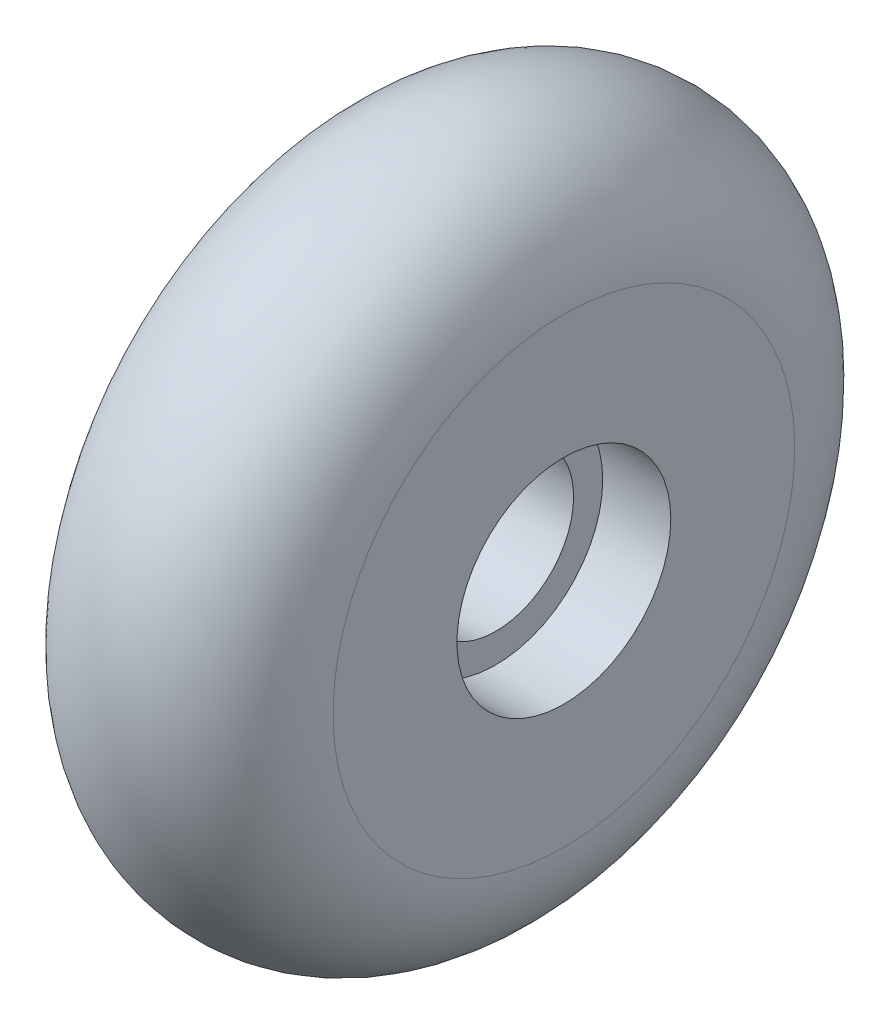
ISO-10303-21;
HEADER;
FILE_DESCRIPTION(('STEP AP214'),'2;1');
FILE_NAME('part.step','',(''),(''),'','','');
FILE_SCHEMA(('AUTOMOTIVE_DESIGN { 1 0 10303 214 1 1 1 1 }'));
ENDSEC;
DATA;
#1=APPLICATION_CONTEXT('core data for automotive mechanical design processes');
#2=APPLICATION_PROTOCOL_DEFINITION('international standard','automotive_design',2000,#1);
#3=PRODUCT_CONTEXT('',#1,'mechanical');
#4=PRODUCT('Part','Part','',(#3));
#5=PRODUCT_RELATED_PRODUCT_CATEGORY('part','',(#4));
#6=PRODUCT_DEFINITION_FORMATION('','',#4);
#7=PRODUCT_DEFINITION_CONTEXT('part definition',#1,'design');
#8=PRODUCT_DEFINITION('design','',#6,#7);
#9=PRODUCT_DEFINITION_SHAPE('','',#8);
#10=(LENGTH_UNIT() NAMED_UNIT(*) SI_UNIT(.MILLI.,.METRE.));
#11=(NAMED_UNIT(*) PLANE_ANGLE_UNIT() SI_UNIT($,.RADIAN.));
#12=(NAMED_UNIT(*) SI_UNIT($,.STERADIAN.) SOLID_ANGLE_UNIT());
#13=UNCERTAINTY_MEASURE_WITH_UNIT(LENGTH_MEASURE(1.E-05),#10,'distance_accuracy_value','');
#14=(GEOMETRIC_REPRESENTATION_CONTEXT(3) GLOBAL_UNCERTAINTY_ASSIGNED_CONTEXT((#13)) GLOBAL_UNIT_ASSIGNED_CONTEXT((#10,
#11,#12)) REPRESENTATION_CONTEXT('',''));
#15=CARTESIAN_POINT('',(0.,0.,0.));
#16=DIRECTION('',(0.,0.,1.));
#17=DIRECTION('',(1.,0.,0.));
#18=AXIS2_PLACEMENT_3D('',#15,#16,#17);
#19=CARTESIAN_POINT('',(0.,-30.8305168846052,0.));
#20=DIRECTION('',(1.,0.,0.));
#21=DIRECTION('',(0.,0.,-1.));
#22=AXIS2_PLACEMENT_3D('',#19,#20,#21);
#23=PLANE('',#22);
#24=CARTESIAN_POINT('',(0.,-23.75,0.));
#25=DIRECTION('',(1.,0.,0.));
#26=DIRECTION('',(0.,0.,-1.));
#27=AXIS2_PLACEMENT_3D('',#24,#25,#26);
#28=CIRCLE('',#27,23.75);
#29=CARTESIAN_POINT('',(0.,-23.75,-23.75));
#30=VERTEX_POINT('',#29);
#31=EDGE_CURVE('E10',#30,#30,#28,.T.);
#32=ORIENTED_EDGE('',*,*,#31,.T.);
#33=EDGE_LOOP('',(#32));
#34=FACE_BOUND('',#33,.T.);
#35=CARTESIAN_POINT('',(0.,-23.75,0.));
#36=DIRECTION('',(1.,0.,0.));
#37=DIRECTION('',(0.,0.,-1.));
#38=AXIS2_PLACEMENT_3D('',#35,#36,#37);
#39=CIRCLE('',#38,11.);
#40=CARTESIAN_POINT('',(0.,-23.75,-11.));
#41=VERTEX_POINT('',#40);
#42=EDGE_CURVE('E57',#41,#41,#39,.T.);
#43=ORIENTED_EDGE('',*,*,#42,.F.);
#44=EDGE_LOOP('',(#43));
#45=FACE_BOUND('',#44,.T.);
#46=ADVANCED_FACE('F29',(#34,#45),#23,.T.);
#47=CARTESIAN_POINT('',(-12.25,-23.75,0.));
#48=DIRECTION('',(1.,0.,0.));
#49=DIRECTION('',(0.,0.,-1.));
#50=AXIS2_PLACEMENT_3D('',#47,#48,#49);
#51=TOROIDAL_SURFACE('',#50,23.75,12.25);
#52=CARTESIAN_POINT('',(-24.5,-23.75,0.));
#53=DIRECTION('',(1.,0.,0.));
#54=DIRECTION('',(0.,0.,-1.));
#55=AXIS2_PLACEMENT_3D('',#52,#53,#54);
#56=CIRCLE('',#55,23.75);
#57=CARTESIAN_POINT('',(-24.5,-23.75,-23.75));
#58=VERTEX_POINT('',#57);
#59=EDGE_CURVE('E35',#58,#58,#56,.T.);
#60=ORIENTED_EDGE('',*,*,#59,.T.);
#61=EDGE_LOOP('',(#60));
#62=FACE_BOUND('',#61,.T.);
#63=ORIENTED_EDGE('',*,*,#31,.F.);
#64=EDGE_LOOP('',(#63));
#65=FACE_BOUND('',#64,.T.);
#66=ADVANCED_FACE('F64',(#62,#65),#51,.T.);
#67=CARTESIAN_POINT('',(-24.5,-30.8305168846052,0.));
#68=DIRECTION('',(1.,0.,0.));
#69=DIRECTION('',(0.,0.,-1.));
#70=AXIS2_PLACEMENT_3D('',#67,#68,#69);
#71=PLANE('',#70);
#72=ORIENTED_EDGE('',*,*,#59,.F.);
#73=EDGE_LOOP('',(#72));
#74=FACE_BOUND('',#73,.T.);
#75=CARTESIAN_POINT('',(-24.5,-23.75,0.));
#76=DIRECTION('',(1.,0.,0.));
#77=DIRECTION('',(0.,0.,-1.));
#78=AXIS2_PLACEMENT_3D('',#75,#76,#77);
#79=CIRCLE('',#78,11.);
#80=CARTESIAN_POINT('',(-24.5,-23.75,-11.));
#81=VERTEX_POINT('',#80);
#82=EDGE_CURVE('E39',#81,#81,#79,.T.);
#83=ORIENTED_EDGE('',*,*,#82,.T.);
#84=EDGE_LOOP('',(#83));
#85=FACE_BOUND('',#84,.T.);
#86=ADVANCED_FACE('F68',(#74,#85),#71,.F.);
#87=CARTESIAN_POINT('',(0.,-23.75,0.));
#88=DIRECTION('',(1.,0.,0.));
#89=DIRECTION('',(0.,0.,-1.));
#90=AXIS2_PLACEMENT_3D('',#87,#88,#89);
#91=CYLINDRICAL_SURFACE('',#90,11.);
#92=CARTESIAN_POINT('',(-17.5,-23.75,0.));
#93=DIRECTION('',(1.,0.,0.));
#94=DIRECTION('',(0.,0.,-1.));
#95=AXIS2_PLACEMENT_3D('',#92,#93,#94);
#96=CIRCLE('',#95,11.);
#97=CARTESIAN_POINT('',(-17.5,-23.75,-11.));
#98=VERTEX_POINT('',#97);
#99=EDGE_CURVE('E43',#98,#98,#96,.T.);
#100=ORIENTED_EDGE('',*,*,#99,.T.);
#101=EDGE_LOOP('',(#100));
#102=FACE_BOUND('',#101,.T.);
#103=ORIENTED_EDGE('',*,*,#82,.F.);
#104=EDGE_LOOP('',(#103));
#105=FACE_BOUND('',#104,.T.);
#106=ADVANCED_FACE('F72',(#102,#105),#91,.F.);
#107=CARTESIAN_POINT('',(-17.5,-30.8305168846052,0.));
#108=DIRECTION('',(1.,0.,0.));
#109=DIRECTION('',(0.,0.,-1.));
#110=AXIS2_PLACEMENT_3D('',#107,#108,#109);
#111=PLANE('',#110);
#112=ORIENTED_EDGE('',*,*,#99,.F.);
#113=EDGE_LOOP('',(#112));
#114=FACE_BOUND('',#113,.T.);
#115=CARTESIAN_POINT('',(-17.5,-23.75,0.));
#116=DIRECTION('',(1.,0.,0.));
#117=DIRECTION('',(0.,0.,-1.));
#118=AXIS2_PLACEMENT_3D('',#115,#116,#117);
#119=CIRCLE('',#118,8.);
#120=CARTESIAN_POINT('',(-17.5,-23.75,-8.));
#121=VERTEX_POINT('',#120);
#122=EDGE_CURVE('E48',#121,#121,#119,.T.);
#123=ORIENTED_EDGE('',*,*,#122,.T.);
#124=EDGE_LOOP('',(#123));
#125=FACE_BOUND('',#124,.T.);
#126=ADVANCED_FACE('F79',(#114,#125),#111,.F.);
#127=CARTESIAN_POINT('',(0.,-23.75,0.));
#128=DIRECTION('',(1.,0.,0.));
#129=DIRECTION('',(0.,0.,-1.));
#130=AXIS2_PLACEMENT_3D('',#127,#128,#129);
#131=CYLINDRICAL_SURFACE('',#130,8.00000000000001);
#132=ORIENTED_EDGE('',*,*,#122,.F.);
#133=EDGE_LOOP('',(#132));
#134=FACE_BOUND('',#133,.T.);
#135=CARTESIAN_POINT('',(-6.99999999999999,-23.75,0.));
#136=DIRECTION('',(1.,0.,0.));
#137=DIRECTION('',(0.,0.,-1.));
#138=AXIS2_PLACEMENT_3D('',#135,#136,#137);
#139=CIRCLE('',#138,8.00000000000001);
#140=CARTESIAN_POINT('',(-6.99999999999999,-23.75,-8.00000000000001));
#141=VERTEX_POINT('',#140);
#142=EDGE_CURVE('E51',#141,#141,#139,.T.);
#143=ORIENTED_EDGE('',*,*,#142,.T.);
#144=EDGE_LOOP('',(#143));
#145=FACE_BOUND('',#144,.T.);
#146=ADVANCED_FACE('F83',(#134,#145),#131,.F.);
#147=CARTESIAN_POINT('',(-7.,-30.8305168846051,0.));
#148=DIRECTION('',(-1.,0.,0.));
#149=DIRECTION('',(0.,0.,1.));
#150=AXIS2_PLACEMENT_3D('',#147,#148,#149);
#151=PLANE('',#150);
#152=ORIENTED_EDGE('',*,*,#142,.F.);
#153=EDGE_LOOP('',(#152));
#154=FACE_BOUND('',#153,.T.);
#155=CARTESIAN_POINT('',(-7.,-23.75,0.));
#156=DIRECTION('',(1.,0.,0.));
#157=DIRECTION('',(0.,0.,-1.));
#158=AXIS2_PLACEMENT_3D('',#155,#156,#157);
#159=CIRCLE('',#158,11.);
#160=CARTESIAN_POINT('',(-7.,-23.75,-11.));
#161=VERTEX_POINT('',#160);
#162=EDGE_CURVE('E54',#161,#161,#159,.T.);
#163=ORIENTED_EDGE('',*,*,#162,.T.);
#164=EDGE_LOOP('',(#163));
#165=FACE_BOUND('',#164,.T.);
#166=ADVANCED_FACE('F87',(#154,#165),#151,.F.);
#167=CARTESIAN_POINT('',(0.,-23.75,0.));
#168=DIRECTION('',(1.,0.,0.));
#169=DIRECTION('',(0.,0.,-1.));
#170=AXIS2_PLACEMENT_3D('',#167,#168,#169);
#171=CYLINDRICAL_SURFACE('',#170,11.);
#172=ORIENTED_EDGE('',*,*,#162,.F.);
#173=EDGE_LOOP('',(#172));
#174=FACE_BOUND('',#173,.T.);
#175=ORIENTED_EDGE('',*,*,#42,.T.);
#176=EDGE_LOOP('',(#175));
#177=FACE_BOUND('',#176,.T.);
#178=ADVANCED_FACE('F61',(#174,#177),#171,.F.);
#179=CLOSED_SHELL('',(#46,#66,#86,#106,#126,#146,#166,#178));
#180=MANIFOLD_SOLID_BREP('B2',#179);
#181=ADVANCED_BREP_SHAPE_REPRESENTATION('',(#18,#180),#14);
#182=SHAPE_DEFINITION_REPRESENTATION(#9,#181);
ENDSEC;
END-ISO-10303-21;
